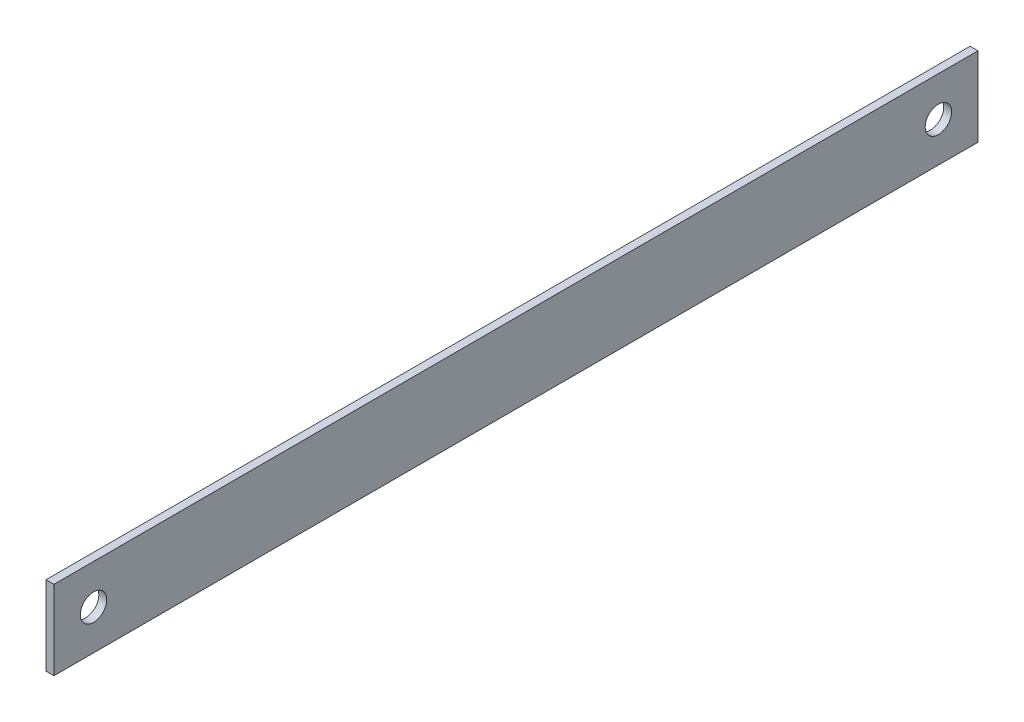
from build123d import *

# Parameters (mm, degrees)
SKETCH1_W           = 350
SKETCH1_H           = 30
BOSS_EXTRUDE1_DEPTH = 1.5
SKETCH2_R           = 5
CUT_EXTRUDE2_DEPTH  = 5


with BuildPart() as part:
    # Sketch1 → Boss-Extrude1 (new, symmetric)
    with BuildSketch(Plane(origin=(0, 0, 0), x_dir=(0, 0, -1), z_dir=(1, 0, 0))):
        Rectangle(SKETCH1_W, SKETCH1_H)
    extrude(amount=BOSS_EXTRUDE1_DEPTH, both=True)

    # Sketch2 → Cut-Extrude2 (cut)
    with BuildSketch(Plane(origin=(1.5, 0, 0), x_dir=(0, 0, -1), z_dir=(1, 0, 0))):
        with Locations((-160, 0)):
            Circle(SKETCH2_R)
        with Locations((160, 0)):
            Circle(SKETCH2_R)
    extrude(amount=-CUT_EXTRUDE2_DEPTH, mode=Mode.SUBTRACT)


solid = part.part
